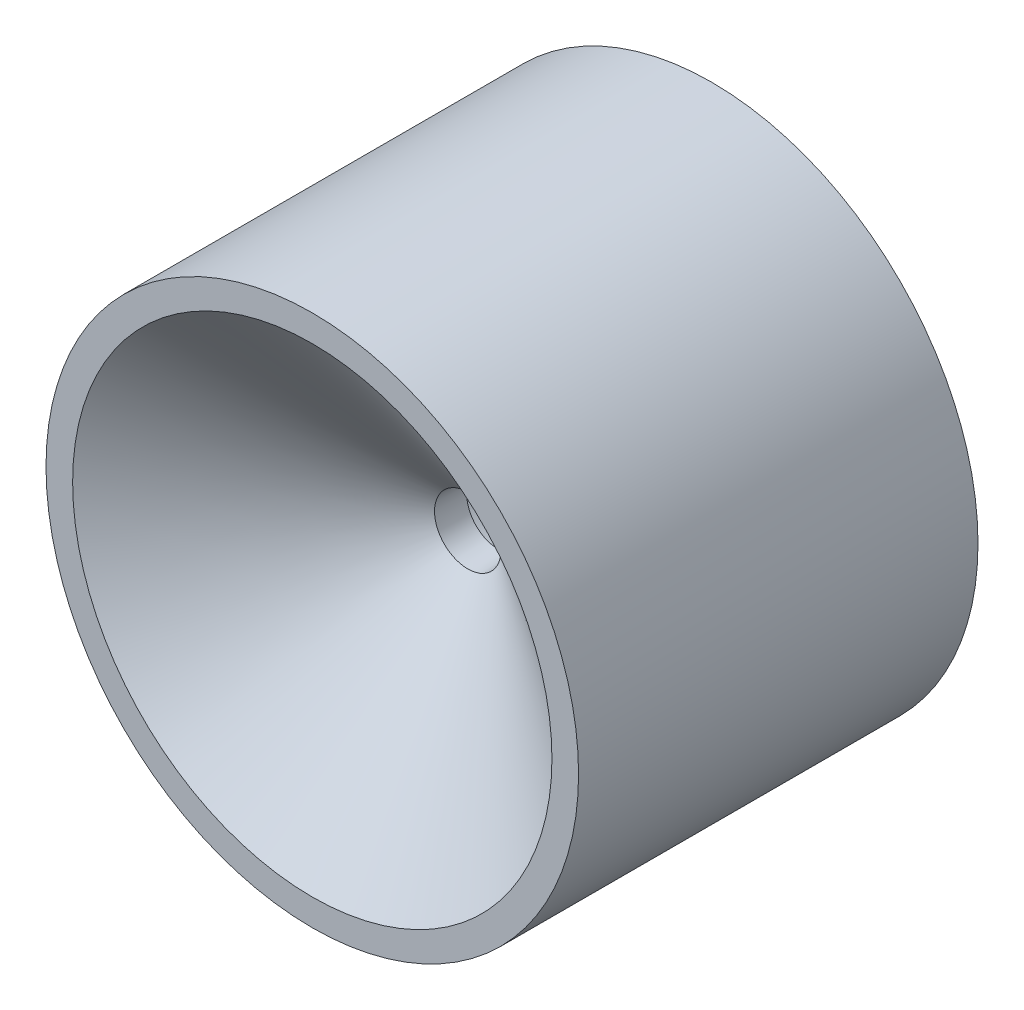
ISO-10303-21;
HEADER;
FILE_DESCRIPTION(('STEP AP214'),'2;1');
FILE_NAME('part.step','',(''),(''),'','','');
FILE_SCHEMA(('AUTOMOTIVE_DESIGN { 1 0 10303 214 1 1 1 1 }'));
ENDSEC;
DATA;
#1=APPLICATION_CONTEXT('core data for automotive mechanical design processes');
#2=APPLICATION_PROTOCOL_DEFINITION('international standard','automotive_design',2000,#1);
#3=PRODUCT_CONTEXT('',#1,'mechanical');
#4=PRODUCT('Part','Part','',(#3));
#5=PRODUCT_RELATED_PRODUCT_CATEGORY('part','',(#4));
#6=PRODUCT_DEFINITION_FORMATION('','',#4);
#7=PRODUCT_DEFINITION_CONTEXT('part definition',#1,'design');
#8=PRODUCT_DEFINITION('design','',#6,#7);
#9=PRODUCT_DEFINITION_SHAPE('','',#8);
#10=(LENGTH_UNIT() NAMED_UNIT(*) SI_UNIT(.MILLI.,.METRE.));
#11=(NAMED_UNIT(*) PLANE_ANGLE_UNIT() SI_UNIT($,.RADIAN.));
#12=(NAMED_UNIT(*) SI_UNIT($,.STERADIAN.) SOLID_ANGLE_UNIT());
#13=UNCERTAINTY_MEASURE_WITH_UNIT(LENGTH_MEASURE(1.E-05),#10,'distance_accuracy_value','');
#14=(GEOMETRIC_REPRESENTATION_CONTEXT(3) GLOBAL_UNCERTAINTY_ASSIGNED_CONTEXT((#13)) GLOBAL_UNIT_ASSIGNED_CONTEXT((#10,
#11,#12)) REPRESENTATION_CONTEXT('',''));
#15=CARTESIAN_POINT('',(0.,0.,0.));
#16=DIRECTION('',(0.,0.,1.));
#17=DIRECTION('',(1.,0.,0.));
#18=AXIS2_PLACEMENT_3D('',#15,#16,#17);
#19=CARTESIAN_POINT('',(0.,0.,0.));
#20=DIRECTION('',(0.,0.,1.));
#21=DIRECTION('',(1.,0.,0.));
#22=AXIS2_PLACEMENT_3D('',#19,#20,#21);
#23=PLANE('',#22);
#24=CARTESIAN_POINT('',(0.,0.,0.));
#25=DIRECTION('',(0.,0.,1.));
#26=DIRECTION('',(1.,0.,0.));
#27=AXIS2_PLACEMENT_3D('',#24,#25,#26);
#28=CIRCLE('',#27,3.4);
#29=CARTESIAN_POINT('',(3.4,0.,0.));
#30=VERTEX_POINT('',#29);
#31=EDGE_CURVE('E46',#30,#30,#28,.T.);
#32=ORIENTED_EDGE('',*,*,#31,.T.);
#33=EDGE_LOOP('',(#32));
#34=FACE_BOUND('',#33,.T.);
#35=CARTESIAN_POINT('',(0.,0.,0.));
#36=DIRECTION('',(0.,0.,-1.));
#37=DIRECTION('',(-1.,0.,0.));
#38=AXIS2_PLACEMENT_3D('',#35,#36,#37);
#39=CIRCLE('',#38,5.5);
#40=CARTESIAN_POINT('',(-5.5,0.,0.));
#41=VERTEX_POINT('',#40);
#42=EDGE_CURVE('E64',#41,#41,#39,.T.);
#43=ORIENTED_EDGE('',*,*,#42,.T.);
#44=EDGE_LOOP('',(#43));
#45=FACE_BOUND('',#44,.T.);
#46=ADVANCED_FACE('F31',(#34,#45),#23,.F.);
#47=CARTESIAN_POINT('',(0.,0.,0.));
#48=DIRECTION('',(0.,0.,-1.));
#49=DIRECTION('',(-1.,0.,0.));
#50=AXIS2_PLACEMENT_3D('',#47,#48,#49);
#51=CIRCLE('',#50,9.);
#52=CARTESIAN_POINT('',(-9.,0.,0.));
#53=VERTEX_POINT('',#52);
#54=EDGE_CURVE('E58',#53,#53,#51,.T.);
#55=ORIENTED_EDGE('',*,*,#54,.F.);
#56=EDGE_LOOP('',(#55));
#57=FACE_BOUND('',#56,.T.);
#58=CARTESIAN_POINT('',(0.,0.,0.));
#59=DIRECTION('',(0.,0.,1.));
#60=DIRECTION('',(1.,0.,0.));
#61=AXIS2_PLACEMENT_3D('',#58,#59,#60);
#62=CIRCLE('',#61,10.);
#63=CARTESIAN_POINT('',(10.,0.,0.));
#64=VERTEX_POINT('',#63);
#65=EDGE_CURVE('E39',#64,#64,#62,.T.);
#66=ORIENTED_EDGE('',*,*,#65,.F.);
#67=EDGE_LOOP('',(#66));
#68=FACE_BOUND('',#67,.T.);
#69=ADVANCED_FACE('F86',(#57,#68),#23,.F.);
#70=CARTESIAN_POINT('',(0.,0.,15.));
#71=DIRECTION('',(0.,0.,-1.));
#72=DIRECTION('',(-1.,0.,0.));
#73=AXIS2_PLACEMENT_3D('',#70,#71,#72);
#74=CYLINDRICAL_SURFACE('',#73,10.);
#75=CARTESIAN_POINT('',(0.,0.,15.));
#76=DIRECTION('',(0.,0.,1.));
#77=DIRECTION('',(1.,0.,0.));
#78=AXIS2_PLACEMENT_3D('',#75,#76,#77);
#79=CIRCLE('',#78,10.);
#80=CARTESIAN_POINT('',(10.,0.,15.));
#81=VERTEX_POINT('',#80);
#82=EDGE_CURVE('E10',#81,#81,#79,.T.);
#83=ORIENTED_EDGE('',*,*,#82,.F.);
#84=EDGE_LOOP('',(#83));
#85=FACE_BOUND('',#84,.T.);
#86=ORIENTED_EDGE('',*,*,#65,.T.);
#87=EDGE_LOOP('',(#86));
#88=FACE_BOUND('',#87,.T.);
#89=ADVANCED_FACE('F33',(#85,#88),#74,.T.);
#90=CARTESIAN_POINT('',(0.,0.,15.));
#91=DIRECTION('',(0.,0.,1.));
#92=DIRECTION('',(1.,0.,0.));
#93=AXIS2_PLACEMENT_3D('',#90,#91,#92);
#94=PLANE('',#93);
#95=CARTESIAN_POINT('',(0.,0.,15.));
#96=DIRECTION('',(0.,0.,1.));
#97=DIRECTION('',(1.,0.,0.));
#98=AXIS2_PLACEMENT_3D('',#95,#96,#97);
#99=CIRCLE('',#98,9.);
#100=CARTESIAN_POINT('',(9.,0.,15.));
#101=VERTEX_POINT('',#100);
#102=EDGE_CURVE('E54',#101,#101,#99,.T.);
#103=ORIENTED_EDGE('',*,*,#102,.F.);
#104=EDGE_LOOP('',(#103));
#105=FACE_BOUND('',#104,.T.);
#106=ORIENTED_EDGE('',*,*,#82,.T.);
#107=EDGE_LOOP('',(#106));
#108=FACE_BOUND('',#107,.T.);
#109=ADVANCED_FACE('F92',(#105,#108),#94,.T.);
#110=CARTESIAN_POINT('',(0.,0.,8.));
#111=DIRECTION('',(0.,0.,-1.));
#112=DIRECTION('',(-1.,0.,0.));
#113=AXIS2_PLACEMENT_3D('',#110,#111,#112);
#114=CYLINDRICAL_SURFACE('',#113,3.4);
#115=CARTESIAN_POINT('',(0.,0.,8.));
#116=DIRECTION('',(0.,0.,1.));
#117=DIRECTION('',(1.,0.,0.));
#118=AXIS2_PLACEMENT_3D('',#115,#116,#117);
#119=CIRCLE('',#118,3.4);
#120=CARTESIAN_POINT('',(3.4,0.,8.));
#121=VERTEX_POINT('',#120);
#122=EDGE_CURVE('E44',#121,#121,#119,.T.);
#123=ORIENTED_EDGE('',*,*,#122,.T.);
#124=EDGE_LOOP('',(#123));
#125=FACE_BOUND('',#124,.T.);
#126=ORIENTED_EDGE('',*,*,#31,.F.);
#127=EDGE_LOOP('',(#126));
#128=FACE_BOUND('',#127,.T.);
#129=ADVANCED_FACE('F97',(#125,#128),#114,.F.);
#130=CARTESIAN_POINT('',(0.,0.,8.));
#131=DIRECTION('',(0.,0.,1.));
#132=DIRECTION('',(1.,0.,0.));
#133=AXIS2_PLACEMENT_3D('',#130,#131,#132);
#134=PLANE('',#133);
#135=CARTESIAN_POINT('',(0.,0.,8.));
#136=DIRECTION('',(0.,0.,-1.));
#137=DIRECTION('',(-1.,0.,0.));
#138=AXIS2_PLACEMENT_3D('',#135,#136,#137);
#139=CIRCLE('',#138,1.2);
#140=CARTESIAN_POINT('',(-1.2,0.,8.));
#141=VERTEX_POINT('',#140);
#142=EDGE_CURVE('E49',#141,#141,#139,.T.);
#143=ORIENTED_EDGE('',*,*,#142,.F.);
#144=EDGE_LOOP('',(#143));
#145=FACE_BOUND('',#144,.T.);
#146=ORIENTED_EDGE('',*,*,#122,.F.);
#147=EDGE_LOOP('',(#146));
#148=FACE_BOUND('',#147,.T.);
#149=ADVANCED_FACE('F108',(#145,#148),#134,.F.);
#150=CARTESIAN_POINT('',(0.,0.,8.));
#151=DIRECTION('',(0.,0.,1.));
#152=DIRECTION('',(-1.,0.,0.));
#153=AXIS2_PLACEMENT_3D('',#150,#151,#152);
#154=CONICAL_SURFACE('',#153,1.2,0.0427605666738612);
#155=CARTESIAN_POINT('',(0.,0.,9.15966850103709));
#156=DIRECTION('',(0.,0.,1.));
#157=DIRECTION('',(1.,0.,0.));
#158=AXIS2_PLACEMENT_3D('',#155,#156,#157);
#159=CIRCLE('',#158,1.24961832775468);
#160=CARTESIAN_POINT('',(1.24961832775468,0.,9.15966850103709));
#161=VERTEX_POINT('',#160);
#162=EDGE_CURVE('E35',#161,#161,#159,.T.);
#163=ORIENTED_EDGE('',*,*,#162,.T.);
#164=EDGE_LOOP('',(#163));
#165=FACE_BOUND('',#164,.T.);
#166=ORIENTED_EDGE('',*,*,#142,.T.);
#167=EDGE_LOOP('',(#166));
#168=FACE_BOUND('',#167,.T.);
#169=ADVANCED_FACE('F112',(#165,#168),#154,.F.);
#170=CARTESIAN_POINT('',(0.,0.,15.));
#171=DIRECTION('',(0.,0.,1.));
#172=DIRECTION('',(1.,0.,0.));
#173=AXIS2_PLACEMENT_3D('',#170,#171,#172);
#174=CONICAL_SURFACE('',#173,9.,0.925024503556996);
#175=CARTESIAN_POINT('',(9.,0.,15.));
#176=CARTESIAN_POINT('',(8.91926685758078,0.,14.9391632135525));
#177=CARTESIAN_POINT('',(8.83853371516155,0.,14.8783264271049));
#178=CARTESIAN_POINT('',(8.67706743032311,0.,14.7566528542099));
#179=CARTESIAN_POINT('',(8.59633428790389,0.,14.6958160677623));
#180=CARTESIAN_POINT('',(8.43486800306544,0.,14.5741424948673));
#181=CARTESIAN_POINT('',(8.35413486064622,0.,14.5133057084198));
#182=CARTESIAN_POINT('',(8.19266857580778,0.,14.3916321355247));
#183=CARTESIAN_POINT('',(8.11193543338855,0.,14.3307953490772));
#184=CARTESIAN_POINT('',(7.95046914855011,0.,14.2091217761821));
#185=CARTESIAN_POINT('',(7.86973600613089,0.,14.1482849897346));
#186=CARTESIAN_POINT('',(7.70826972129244,0.,14.0266114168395));
#187=CARTESIAN_POINT('',(7.62753657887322,0.,13.965774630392));
#188=CARTESIAN_POINT('',(7.46607029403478,0.,13.8441010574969));
#189=CARTESIAN_POINT('',(7.38533715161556,0.,13.7832642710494));
#190=CARTESIAN_POINT('',(7.22387086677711,0.,13.6615906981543));
#191=CARTESIAN_POINT('',(7.14313772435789,0.,13.6007539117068));
#192=CARTESIAN_POINT('',(6.98167143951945,0.,13.4790803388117));
#193=CARTESIAN_POINT('',(6.90093829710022,0.,13.4182435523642));
#194=CARTESIAN_POINT('',(6.73947201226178,0.,13.2965699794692));
#195=CARTESIAN_POINT('',(6.65873886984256,0.,13.2357331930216));
#196=CARTESIAN_POINT('',(6.49727258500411,0.,13.1140596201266));
#197=CARTESIAN_POINT('',(6.41653944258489,0.,13.053222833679));
#198=CARTESIAN_POINT('',(6.25507315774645,0.,12.931549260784));
#199=CARTESIAN_POINT('',(6.17434001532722,0.,12.8707124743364));
#200=CARTESIAN_POINT('',(6.01287373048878,0.,12.7490389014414));
#201=CARTESIAN_POINT('',(5.93214058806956,0.,12.6882021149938));
#202=CARTESIAN_POINT('',(5.77067430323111,0.,12.5665285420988));
#203=CARTESIAN_POINT('',(5.68994116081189,0.,12.5056917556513));
#204=CARTESIAN_POINT('',(5.52847487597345,0.,12.3840181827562));
#205=CARTESIAN_POINT('',(5.44774173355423,0.,12.3231813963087));
#206=CARTESIAN_POINT('',(5.28627544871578,0.,12.2015078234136));
#207=CARTESIAN_POINT('',(5.20554230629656,0.,12.1406710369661));
#208=CARTESIAN_POINT('',(5.04407602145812,0.,12.018997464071));
#209=CARTESIAN_POINT('',(4.96334287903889,0.,11.9581606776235));
#210=CARTESIAN_POINT('',(4.80187659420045,0.,11.8364871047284));
#211=CARTESIAN_POINT('',(4.72114345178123,0.,11.7756503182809));
#212=CARTESIAN_POINT('',(4.55967716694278,0.,11.6539767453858));
#213=CARTESIAN_POINT('',(4.47894402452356,0.,11.5931399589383));
#214=CARTESIAN_POINT('',(4.31747773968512,0.,11.4714663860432));
#215=CARTESIAN_POINT('',(4.23674459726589,0.,11.4106295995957));
#216=CARTESIAN_POINT('',(4.07527831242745,0.,11.2889560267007));
#217=CARTESIAN_POINT('',(3.99454517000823,0.,11.2281192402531));
#218=CARTESIAN_POINT('',(3.83307888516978,0.,11.1064456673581));
#219=CARTESIAN_POINT('',(3.75234574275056,0.,11.0456088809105));
#220=CARTESIAN_POINT('',(3.59087945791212,0.,10.9239353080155));
#221=CARTESIAN_POINT('',(3.5101463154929,0.,10.8630985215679));
#222=CARTESIAN_POINT('',(3.34868003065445,0.,10.7414249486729));
#223=CARTESIAN_POINT('',(3.26794688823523,0.,10.6805881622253));
#224=CARTESIAN_POINT('',(3.10648060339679,0.,10.5589145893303));
#225=CARTESIAN_POINT('',(3.02574746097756,0.,10.4980778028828));
#226=CARTESIAN_POINT('',(2.86428117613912,0.,10.3764042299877));
#227=CARTESIAN_POINT('',(2.7835480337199,0.,10.3155674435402));
#228=CARTESIAN_POINT('',(2.62208174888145,0.,10.1938938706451));
#229=CARTESIAN_POINT('',(2.54134860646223,0.,10.1330570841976));
#230=CARTESIAN_POINT('',(2.37988232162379,0.,10.0113835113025));
#231=CARTESIAN_POINT('',(2.29914917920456,0.,9.95054672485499));
#232=CARTESIAN_POINT('',(2.13768289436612,0.,9.82887315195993));
#233=CARTESIAN_POINT('',(2.0569497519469,0.,9.76803636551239));
#234=CARTESIAN_POINT('',(1.89548346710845,0.,9.64636279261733));
#235=CARTESIAN_POINT('',(1.81475032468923,0.,9.5855260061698));
#236=CARTESIAN_POINT('',(1.65328403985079,0.,9.46385243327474));
#237=CARTESIAN_POINT('',(1.57255089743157,0.,9.40301564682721));
#238=CARTESIAN_POINT('',(1.41108461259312,0.,9.28134207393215));
#239=CARTESIAN_POINT('',(1.3303514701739,0.,9.22050528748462));
#240=CARTESIAN_POINT('',(1.24961832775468,0.,9.15966850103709));
#241=B_SPLINE_CURVE_WITH_KNOTS('',3,(#175,#176,#177,#178,#179,#180,#181,#182,#183,#184,#185,
#186,#187,#188,#189,#190,#191,#192,#193,#194,#195,#196,#197,#198,#199,#200,#201,#202,#203,#204,
#205,#206,#207,#208,#209,#210,#211,#212,#213,#214,#215,#216,#217,#218,#219,#220,#221,#222,#223,
#224,#225,#226,#227,#228,#229,#230,#231,#232,#233,#234,#235,#236,#237,#238,#239,#240),
.UNSPECIFIED.,.F.,.F.,(4,2,2,2,2,2,2,2,2,2,2,2,2,2,2,2,2,2,2,2,2,2,2,2,2,2,2,2,2,2,2,2,4),(0.,
0.303266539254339,0.606533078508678,0.909799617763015,1.21306615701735,1.51633269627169,
1.81959923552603,2.12286577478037,2.42613231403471,2.72939885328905,3.03266539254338,
3.33593193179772,3.63919847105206,3.9424650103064,4.24573154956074,4.54899808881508,
4.85226462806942,5.15553116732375,5.45879770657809,5.76206424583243,6.06533078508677,
6.36859732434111,6.67186386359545,6.97513040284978,7.27839694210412,7.58166348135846,
7.8849300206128,8.18819655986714,8.49146309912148,8.79472963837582,9.09799617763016,
9.4012627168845,9.70452925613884),.UNSPECIFIED.);
#242=EDGE_CURVE('BSEAM82',#101,#161,#241,.T.);
#243=ORIENTED_EDGE('',*,*,#102,.T.);
#244=ORIENTED_EDGE('',*,*,#162,.F.);
#245=ORIENTED_EDGE('',*,*,#242,.T.);
#246=ORIENTED_EDGE('',*,*,#242,.F.);
#247=EDGE_LOOP('',(#243,#245,#244,#246));
#248=FACE_BOUND('',#247,.T.);
#249=ADVANCED_FACE('F82',(#248),#174,.F.);
#250=CARTESIAN_POINT('',(0.,0.,11.5));
#251=DIRECTION('',(0.,0.,-1.));
#252=DIRECTION('',(-1.,0.,0.));
#253=AXIS2_PLACEMENT_3D('',#250,#251,#252);
#254=CYLINDRICAL_SURFACE('',#253,9.);
#255=CARTESIAN_POINT('',(0.,0.,11.5));
#256=DIRECTION('',(0.,0.,-1.));
#257=DIRECTION('',(-1.,0.,0.));
#258=AXIS2_PLACEMENT_3D('',#255,#256,#257);
#259=CIRCLE('',#258,9.);
#260=CARTESIAN_POINT('',(-9.,0.,11.5));
#261=VERTEX_POINT('',#260);
#262=EDGE_CURVE('E57',#261,#261,#259,.T.);
#263=ORIENTED_EDGE('',*,*,#262,.F.);
#264=EDGE_LOOP('',(#263));
#265=FACE_BOUND('',#264,.T.);
#266=ORIENTED_EDGE('',*,*,#54,.T.);
#267=EDGE_LOOP('',(#266));
#268=FACE_BOUND('',#267,.T.);
#269=ADVANCED_FACE('F76',(#265,#268),#254,.F.);
#270=CARTESIAN_POINT('',(0.,0.,11.5));
#271=DIRECTION('',(0.,0.,-1.));
#272=DIRECTION('',(-1.,0.,0.));
#273=AXIS2_PLACEMENT_3D('',#270,#271,#272);
#274=PLANE('',#273);
#275=CARTESIAN_POINT('',(0.,0.,11.5));
#276=DIRECTION('',(0.,0.,-1.));
#277=DIRECTION('',(-1.,0.,0.));
#278=AXIS2_PLACEMENT_3D('',#275,#276,#277);
#279=CIRCLE('',#278,5.5);
#280=CARTESIAN_POINT('',(-5.5,0.,11.5));
#281=VERTEX_POINT('',#280);
#282=EDGE_CURVE('E61',#281,#281,#279,.T.);
#283=ORIENTED_EDGE('',*,*,#282,.F.);
#284=EDGE_LOOP('',(#283));
#285=FACE_BOUND('',#284,.T.);
#286=ORIENTED_EDGE('',*,*,#262,.T.);
#287=EDGE_LOOP('',(#286));
#288=FACE_BOUND('',#287,.T.);
#289=ADVANCED_FACE('F73',(#285,#288),#274,.T.);
#290=CARTESIAN_POINT('',(0.,0.,11.5));
#291=DIRECTION('',(0.,0.,-1.));
#292=DIRECTION('',(-1.,0.,0.));
#293=AXIS2_PLACEMENT_3D('',#290,#291,#292);
#294=CYLINDRICAL_SURFACE('',#293,5.5);
#295=ORIENTED_EDGE('',*,*,#282,.T.);
#296=EDGE_LOOP('',(#295));
#297=FACE_BOUND('',#296,.T.);
#298=ORIENTED_EDGE('',*,*,#42,.F.);
#299=EDGE_LOOP('',(#298));
#300=FACE_BOUND('',#299,.T.);
#301=ADVANCED_FACE('F70',(#297,#300),#294,.T.);
#302=CLOSED_SHELL('',(#46,#69,#89,#109,#129,#149,#169,#249,#269,#289,#301));
#303=MANIFOLD_SOLID_BREP('B2',#302);
#304=ADVANCED_BREP_SHAPE_REPRESENTATION('',(#18,#303),#14);
#305=SHAPE_DEFINITION_REPRESENTATION(#9,#304);
ENDSEC;
END-ISO-10303-21;
